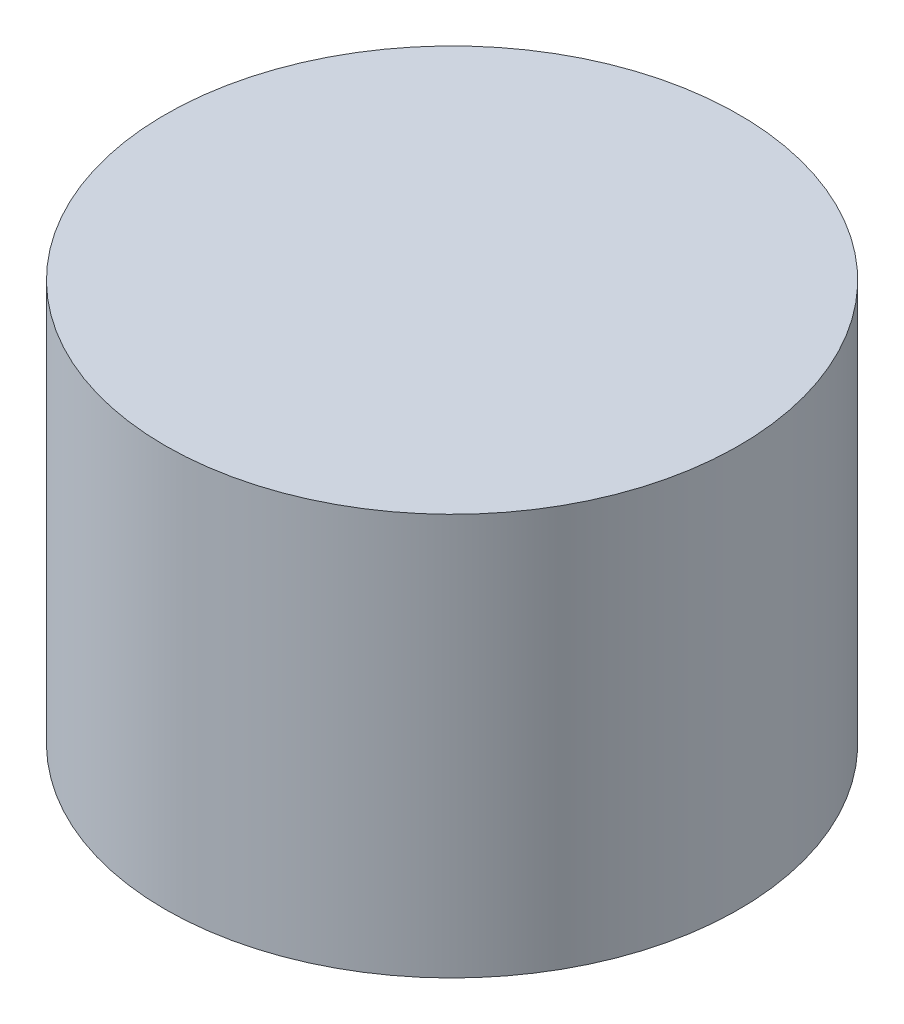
ISO-10303-21;
HEADER;
FILE_DESCRIPTION(('STEP AP214'),'2;1');
FILE_NAME('part.step','',(''),(''),'','','');
FILE_SCHEMA(('AUTOMOTIVE_DESIGN { 1 0 10303 214 1 1 1 1 }'));
ENDSEC;
DATA;
#1=APPLICATION_CONTEXT('core data for automotive mechanical design processes');
#2=APPLICATION_PROTOCOL_DEFINITION('international standard','automotive_design',2000,#1);
#3=PRODUCT_CONTEXT('',#1,'mechanical');
#4=PRODUCT('Part','Part','',(#3));
#5=PRODUCT_RELATED_PRODUCT_CATEGORY('part','',(#4));
#6=PRODUCT_DEFINITION_FORMATION('','',#4);
#7=PRODUCT_DEFINITION_CONTEXT('part definition',#1,'design');
#8=PRODUCT_DEFINITION('design','',#6,#7);
#9=PRODUCT_DEFINITION_SHAPE('','',#8);
#10=(LENGTH_UNIT() NAMED_UNIT(*) SI_UNIT(.MILLI.,.METRE.));
#11=(NAMED_UNIT(*) PLANE_ANGLE_UNIT() SI_UNIT($,.RADIAN.));
#12=(NAMED_UNIT(*) SI_UNIT($,.STERADIAN.) SOLID_ANGLE_UNIT());
#13=UNCERTAINTY_MEASURE_WITH_UNIT(LENGTH_MEASURE(1.E-05),#10,'distance_accuracy_value','');
#14=(GEOMETRIC_REPRESENTATION_CONTEXT(3) GLOBAL_UNCERTAINTY_ASSIGNED_CONTEXT((#13)) GLOBAL_UNIT_ASSIGNED_CONTEXT((#10,
#11,#12)) REPRESENTATION_CONTEXT('',''));
#15=CARTESIAN_POINT('',(0.,0.,0.));
#16=DIRECTION('',(0.,0.,1.));
#17=DIRECTION('',(1.,0.,0.));
#18=AXIS2_PLACEMENT_3D('',#15,#16,#17);
#19=CARTESIAN_POINT('',(0.,33.25,0.));
#20=DIRECTION('',(0.,-1.,0.));
#21=DIRECTION('',(0.,0.,-1.));
#22=AXIS2_PLACEMENT_3D('',#19,#20,#21);
#23=CYLINDRICAL_SURFACE('',#22,22.5);
#24=CARTESIAN_POINT('',(0.,33.25,0.));
#25=DIRECTION('',(0.,1.,0.));
#26=DIRECTION('',(0.,0.,1.));
#27=AXIS2_PLACEMENT_3D('',#24,#25,#26);
#28=CIRCLE('',#27,22.5);
#29=CARTESIAN_POINT('',(0.,33.25,22.5));
#30=VERTEX_POINT('',#29);
#31=EDGE_CURVE('E10',#30,#30,#28,.T.);
#32=ORIENTED_EDGE('',*,*,#31,.F.);
#33=EDGE_LOOP('',(#32));
#34=FACE_BOUND('',#33,.T.);
#35=CARTESIAN_POINT('',(0.,1.75,0.));
#36=DIRECTION('',(0.,1.,0.));
#37=DIRECTION('',(0.,0.,1.));
#38=AXIS2_PLACEMENT_3D('',#35,#36,#37);
#39=CIRCLE('',#38,22.5);
#40=CARTESIAN_POINT('',(0.,1.75,22.5));
#41=VERTEX_POINT('',#40);
#42=EDGE_CURVE('E39',#41,#41,#39,.T.);
#43=ORIENTED_EDGE('',*,*,#42,.T.);
#44=EDGE_LOOP('',(#43));
#45=FACE_BOUND('',#44,.T.);
#46=ADVANCED_FACE('F36',(#34,#45),#23,.T.);
#47=CARTESIAN_POINT('',(0.,33.25,0.));
#48=DIRECTION('',(0.,1.,0.));
#49=DIRECTION('',(0.,0.,1.));
#50=AXIS2_PLACEMENT_3D('',#47,#48,#49);
#51=PLANE('',#50);
#52=ORIENTED_EDGE('',*,*,#31,.T.);
#53=EDGE_LOOP('',(#52));
#54=FACE_BOUND('',#53,.T.);
#55=ADVANCED_FACE('F53',(#54),#51,.T.);
#56=CARTESIAN_POINT('',(0.,1.75,0.));
#57=DIRECTION('',(0.,1.,0.));
#58=DIRECTION('',(0.,0.,1.));
#59=AXIS2_PLACEMENT_3D('',#56,#57,#58);
#60=PLANE('',#59);
#61=ORIENTED_EDGE('',*,*,#42,.F.);
#62=EDGE_LOOP('',(#61));
#63=FACE_BOUND('',#62,.T.);
#64=ADVANCED_FACE('F51',(#63),#60,.F.);
#65=CLOSED_SHELL('',(#46,#55,#64));
#66=MANIFOLD_SOLID_BREP('B2',#65);
#67=ADVANCED_BREP_SHAPE_REPRESENTATION('',(#18,#66),#14);
#68=SHAPE_DEFINITION_REPRESENTATION(#9,#67);
ENDSEC;
END-ISO-10303-21;
